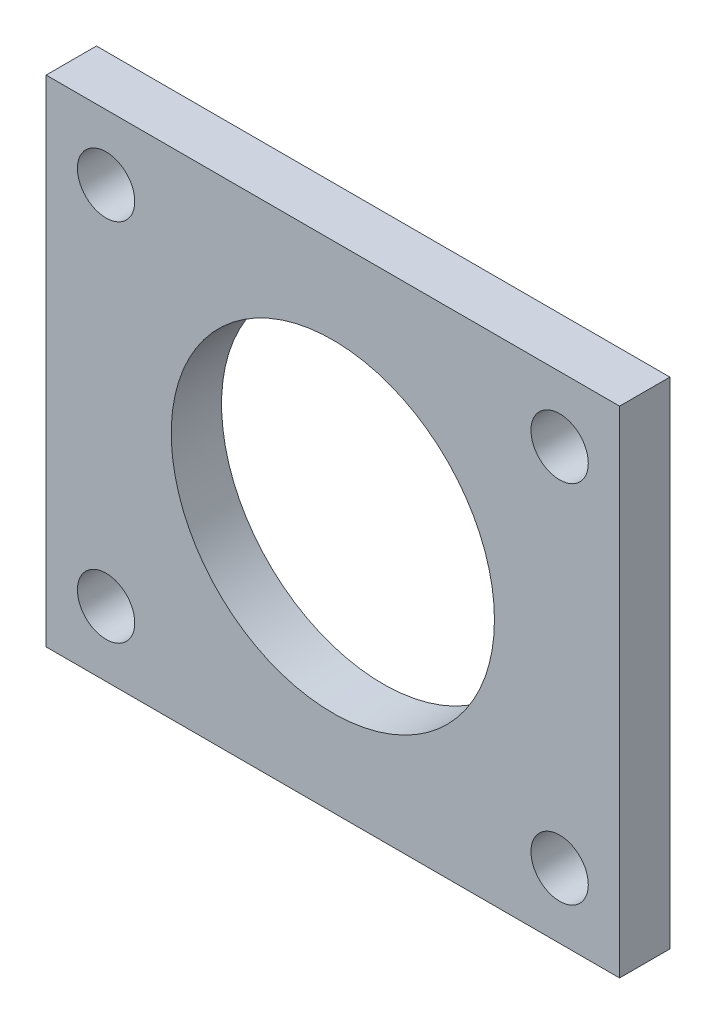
ISO-10303-21;
HEADER;
FILE_DESCRIPTION(('STEP AP214'),'2;1');
FILE_NAME('part.step','',(''),(''),'','','');
FILE_SCHEMA(('AUTOMOTIVE_DESIGN { 1 0 10303 214 1 1 1 1 }'));
ENDSEC;
DATA;
#1=APPLICATION_CONTEXT('core data for automotive mechanical design processes');
#2=APPLICATION_PROTOCOL_DEFINITION('international standard','automotive_design',2000,#1);
#3=PRODUCT_CONTEXT('',#1,'mechanical');
#4=PRODUCT('Part','Part','',(#3));
#5=PRODUCT_RELATED_PRODUCT_CATEGORY('part','',(#4));
#6=PRODUCT_DEFINITION_FORMATION('','',#4);
#7=PRODUCT_DEFINITION_CONTEXT('part definition',#1,'design');
#8=PRODUCT_DEFINITION('design','',#6,#7);
#9=PRODUCT_DEFINITION_SHAPE('','',#8);
#10=(LENGTH_UNIT() NAMED_UNIT(*) SI_UNIT(.MILLI.,.METRE.));
#11=(NAMED_UNIT(*) PLANE_ANGLE_UNIT() SI_UNIT($,.RADIAN.));
#12=(NAMED_UNIT(*) SI_UNIT($,.STERADIAN.) SOLID_ANGLE_UNIT());
#13=UNCERTAINTY_MEASURE_WITH_UNIT(LENGTH_MEASURE(1.E-05),#10,'distance_accuracy_value','');
#14=(GEOMETRIC_REPRESENTATION_CONTEXT(3) GLOBAL_UNCERTAINTY_ASSIGNED_CONTEXT((#13)) GLOBAL_UNIT_ASSIGNED_CONTEXT((#10,
#11,#12)) REPRESENTATION_CONTEXT('',''));
#15=CARTESIAN_POINT('',(0.,0.,0.));
#16=DIRECTION('',(0.,0.,1.));
#17=DIRECTION('',(1.,0.,0.));
#18=AXIS2_PLACEMENT_3D('',#15,#16,#17);
#19=CARTESIAN_POINT('',(0.,0.,9.65));
#20=DIRECTION('',(0.,0.,1.));
#21=DIRECTION('',(1.,0.,0.));
#22=AXIS2_PLACEMENT_3D('',#19,#20,#21);
#23=PLANE('',#22);
#24=CARTESIAN_POINT('',(43.5,-35.,9.65));
#25=DIRECTION('',(0.,0.,1.));
#26=DIRECTION('',(1.,0.,0.));
#27=AXIS2_PLACEMENT_3D('',#24,#25,#26);
#28=CIRCLE('',#27,5.5);
#29=CARTESIAN_POINT('',(49.,-35.,9.65));
#30=VERTEX_POINT('',#29);
#31=EDGE_CURVE('E127',#30,#30,#28,.T.);
#32=ORIENTED_EDGE('',*,*,#31,.F.);
#33=EDGE_LOOP('',(#32));
#34=FACE_BOUND('',#33,.T.);
#35=CARTESIAN_POINT('',(-43.5,35.,9.65));
#36=DIRECTION('',(0.,0.,1.));
#37=DIRECTION('',(1.,0.,0.));
#38=AXIS2_PLACEMENT_3D('',#35,#36,#37);
#39=CIRCLE('',#38,5.5);
#40=CARTESIAN_POINT('',(-38.,35.,9.65));
#41=VERTEX_POINT('',#40);
#42=EDGE_CURVE('E115',#41,#41,#39,.T.);
#43=ORIENTED_EDGE('',*,*,#42,.F.);
#44=EDGE_LOOP('',(#43));
#45=FACE_BOUND('',#44,.T.);
#46=DIRECTION('',(0.,-1.,0.));
#47=VECTOR('',#46,1.);
#48=CARTESIAN_POINT('',(-55.,-47.5,9.65));
#49=LINE('',#48,#47);
#50=CARTESIAN_POINT('',(-55.,47.5,9.65));
#51=VERTEX_POINT('',#50);
#52=CARTESIAN_POINT('',(-55.,-47.5,9.65));
#53=VERTEX_POINT('',#52);
#54=EDGE_CURVE('E85',#51,#53,#49,.T.);
#55=ORIENTED_EDGE('',*,*,#54,.T.);
#56=DIRECTION('',(1.,0.,0.));
#57=VECTOR('',#56,1.);
#58=CARTESIAN_POINT('',(55.,-47.5,9.65));
#59=LINE('',#58,#57);
#60=CARTESIAN_POINT('',(55.,-47.5,9.65));
#61=VERTEX_POINT('',#60);
#62=EDGE_CURVE('E80',#53,#61,#59,.T.);
#63=ORIENTED_EDGE('',*,*,#62,.T.);
#64=DIRECTION('',(0.,1.,0.));
#65=VECTOR('',#64,1.);
#66=CARTESIAN_POINT('',(55.,-47.5,9.65));
#67=LINE('',#66,#65);
#68=CARTESIAN_POINT('',(55.,47.5,9.65));
#69=VERTEX_POINT('',#68);
#70=EDGE_CURVE('E83',#61,#69,#67,.T.);
#71=ORIENTED_EDGE('',*,*,#70,.T.);
#72=DIRECTION('',(-1.,0.,0.));
#73=VECTOR('',#72,1.);
#74=CARTESIAN_POINT('',(55.,47.5,9.65));
#75=LINE('',#74,#73);
#76=EDGE_CURVE('E50',#69,#51,#75,.T.);
#77=ORIENTED_EDGE('',*,*,#76,.T.);
#78=EDGE_LOOP('',(#55,#63,#71,#77));
#79=FACE_BOUND('',#78,.T.);
#80=CARTESIAN_POINT('',(0.,0.,9.65));
#81=DIRECTION('',(0.,0.,1.));
#82=DIRECTION('',(1.,0.,0.));
#83=AXIS2_PLACEMENT_3D('',#80,#81,#82);
#84=CIRCLE('',#83,31.);
#85=CARTESIAN_POINT('',(31.,0.,9.65));
#86=VERTEX_POINT('',#85);
#87=EDGE_CURVE('E100',#86,#86,#84,.T.);
#88=ORIENTED_EDGE('',*,*,#87,.F.);
#89=EDGE_LOOP('',(#88));
#90=FACE_BOUND('',#89,.T.);
#91=CARTESIAN_POINT('',(43.5,35.,9.65));
#92=DIRECTION('',(0.,0.,1.));
#93=DIRECTION('',(1.,0.,0.));
#94=AXIS2_PLACEMENT_3D('',#91,#92,#93);
#95=CIRCLE('',#94,5.5);
#96=CARTESIAN_POINT('',(49.,35.,9.65));
#97=VERTEX_POINT('',#96);
#98=EDGE_CURVE('E121',#97,#97,#95,.T.);
#99=ORIENTED_EDGE('',*,*,#98,.F.);
#100=EDGE_LOOP('',(#99));
#101=FACE_BOUND('',#100,.T.);
#102=CARTESIAN_POINT('',(-43.5,-35.,9.65));
#103=DIRECTION('',(0.,0.,1.));
#104=DIRECTION('',(1.,0.,0.));
#105=AXIS2_PLACEMENT_3D('',#102,#103,#104);
#106=CIRCLE('',#105,5.5);
#107=CARTESIAN_POINT('',(-38.,-35.,9.65));
#108=VERTEX_POINT('',#107);
#109=EDGE_CURVE('E133',#108,#108,#106,.T.);
#110=ORIENTED_EDGE('',*,*,#109,.F.);
#111=EDGE_LOOP('',(#110));
#112=FACE_BOUND('',#111,.T.);
#113=ADVANCED_FACE('F33',(#34,#45,#79,#90,#101,#112),#23,.T.);
#114=CARTESIAN_POINT('',(0.,0.,0.));
#115=DIRECTION('',(0.,0.,1.));
#116=DIRECTION('',(1.,0.,0.));
#117=AXIS2_PLACEMENT_3D('',#114,#115,#116);
#118=PLANE('',#117);
#119=DIRECTION('',(0.,-1.,0.));
#120=VECTOR('',#119,1.);
#121=CARTESIAN_POINT('',(-55.,-47.5,0.));
#122=LINE('',#121,#120);
#123=CARTESIAN_POINT('',(-55.,47.5,0.));
#124=VERTEX_POINT('',#123);
#125=CARTESIAN_POINT('',(-55.,-47.5,0.));
#126=VERTEX_POINT('',#125);
#127=EDGE_CURVE('E97',#124,#126,#122,.T.);
#128=ORIENTED_EDGE('',*,*,#127,.F.);
#129=DIRECTION('',(-1.,0.,0.));
#130=VECTOR('',#129,1.);
#131=CARTESIAN_POINT('',(55.,47.5,0.));
#132=LINE('',#131,#130);
#133=CARTESIAN_POINT('',(55.,47.5,0.));
#134=VERTEX_POINT('',#133);
#135=EDGE_CURVE('E73',#134,#124,#132,.T.);
#136=ORIENTED_EDGE('',*,*,#135,.F.);
#137=DIRECTION('',(0.,1.,0.));
#138=VECTOR('',#137,1.);
#139=CARTESIAN_POINT('',(55.,-47.5,0.));
#140=LINE('',#139,#138);
#141=CARTESIAN_POINT('',(55.,-47.5,0.));
#142=VERTEX_POINT('',#141);
#143=EDGE_CURVE('E67',#142,#134,#140,.T.);
#144=ORIENTED_EDGE('',*,*,#143,.F.);
#145=DIRECTION('',(1.,0.,0.));
#146=VECTOR('',#145,1.);
#147=CARTESIAN_POINT('',(55.,-47.5,0.));
#148=LINE('',#147,#146);
#149=EDGE_CURVE('E89',#126,#142,#148,.T.);
#150=ORIENTED_EDGE('',*,*,#149,.F.);
#151=EDGE_LOOP('',(#128,#136,#144,#150));
#152=FACE_BOUND('',#151,.T.);
#153=CARTESIAN_POINT('',(0.,0.,0.));
#154=DIRECTION('',(0.,0.,1.));
#155=DIRECTION('',(1.,0.,0.));
#156=AXIS2_PLACEMENT_3D('',#153,#154,#155);
#157=CIRCLE('',#156,31.);
#158=CARTESIAN_POINT('',(31.,0.,0.));
#159=VERTEX_POINT('',#158);
#160=EDGE_CURVE('E112',#159,#159,#157,.T.);
#161=ORIENTED_EDGE('',*,*,#160,.T.);
#162=EDGE_LOOP('',(#161));
#163=FACE_BOUND('',#162,.T.);
#164=CARTESIAN_POINT('',(-43.5,35.,0.));
#165=DIRECTION('',(0.,0.,1.));
#166=DIRECTION('',(1.,0.,0.));
#167=AXIS2_PLACEMENT_3D('',#164,#165,#166);
#168=CIRCLE('',#167,5.5);
#169=CARTESIAN_POINT('',(-38.,35.,0.));
#170=VERTEX_POINT('',#169);
#171=EDGE_CURVE('E118',#170,#170,#168,.T.);
#172=ORIENTED_EDGE('',*,*,#171,.T.);
#173=EDGE_LOOP('',(#172));
#174=FACE_BOUND('',#173,.T.);
#175=CARTESIAN_POINT('',(43.5,35.,0.));
#176=DIRECTION('',(0.,0.,1.));
#177=DIRECTION('',(1.,0.,0.));
#178=AXIS2_PLACEMENT_3D('',#175,#176,#177);
#179=CIRCLE('',#178,5.5);
#180=CARTESIAN_POINT('',(49.,35.,0.));
#181=VERTEX_POINT('',#180);
#182=EDGE_CURVE('E124',#181,#181,#179,.T.);
#183=ORIENTED_EDGE('',*,*,#182,.T.);
#184=EDGE_LOOP('',(#183));
#185=FACE_BOUND('',#184,.T.);
#186=CARTESIAN_POINT('',(43.5,-35.,0.));
#187=DIRECTION('',(0.,0.,1.));
#188=DIRECTION('',(1.,0.,0.));
#189=AXIS2_PLACEMENT_3D('',#186,#187,#188);
#190=CIRCLE('',#189,5.5);
#191=CARTESIAN_POINT('',(49.,-35.,0.));
#192=VERTEX_POINT('',#191);
#193=EDGE_CURVE('E130',#192,#192,#190,.T.);
#194=ORIENTED_EDGE('',*,*,#193,.T.);
#195=EDGE_LOOP('',(#194));
#196=FACE_BOUND('',#195,.T.);
#197=CARTESIAN_POINT('',(-43.5,-35.,0.));
#198=DIRECTION('',(0.,0.,1.));
#199=DIRECTION('',(1.,0.,0.));
#200=AXIS2_PLACEMENT_3D('',#197,#198,#199);
#201=CIRCLE('',#200,5.5);
#202=CARTESIAN_POINT('',(-38.,-35.,0.));
#203=VERTEX_POINT('',#202);
#204=EDGE_CURVE('E136',#203,#203,#201,.T.);
#205=ORIENTED_EDGE('',*,*,#204,.T.);
#206=EDGE_LOOP('',(#205));
#207=FACE_BOUND('',#206,.T.);
#208=ADVANCED_FACE('F108',(#152,#163,#174,#185,#196,#207),#118,.F.);
#209=CARTESIAN_POINT('',(-55.,-47.5,9.65));
#210=DIRECTION('',(1.,0.,0.));
#211=DIRECTION('',(0.,0.,-1.));
#212=AXIS2_PLACEMENT_3D('',#209,#210,#211);
#213=PLANE('',#212);
#214=ORIENTED_EDGE('',*,*,#127,.T.);
#215=DIRECTION('',(0.,0.,-1.));
#216=VECTOR('',#215,1.);
#217=CARTESIAN_POINT('',(-55.,-47.5,9.65));
#218=LINE('',#217,#216);
#219=EDGE_CURVE('E11',#53,#126,#218,.T.);
#220=ORIENTED_EDGE('',*,*,#219,.F.);
#221=ORIENTED_EDGE('',*,*,#54,.F.);
#222=DIRECTION('',(0.,0.,-1.));
#223=VECTOR('',#222,1.);
#224=CARTESIAN_POINT('',(-55.,47.5,9.65));
#225=LINE('',#224,#223);
#226=EDGE_CURVE('E93',#51,#124,#225,.T.);
#227=ORIENTED_EDGE('',*,*,#226,.T.);
#228=EDGE_LOOP('',(#214,#220,#221,#227));
#229=FACE_BOUND('',#228,.T.);
#230=ADVANCED_FACE('F35',(#229),#213,.F.);
#231=CARTESIAN_POINT('',(55.,-47.5,9.65));
#232=DIRECTION('',(0.,1.,0.));
#233=DIRECTION('',(-1.,0.,0.));
#234=AXIS2_PLACEMENT_3D('',#231,#232,#233);
#235=PLANE('',#234);
#236=ORIENTED_EDGE('',*,*,#149,.T.);
#237=DIRECTION('',(0.,0.,-1.));
#238=VECTOR('',#237,1.);
#239=CARTESIAN_POINT('',(55.,-47.5,9.65));
#240=LINE('',#239,#238);
#241=EDGE_CURVE('E42',#61,#142,#240,.T.);
#242=ORIENTED_EDGE('',*,*,#241,.F.);
#243=ORIENTED_EDGE('',*,*,#62,.F.);
#244=ORIENTED_EDGE('',*,*,#219,.T.);
#245=EDGE_LOOP('',(#236,#242,#243,#244));
#246=FACE_BOUND('',#245,.T.);
#247=ADVANCED_FACE('F88',(#246),#235,.F.);
#248=CARTESIAN_POINT('',(55.,-47.5,9.65));
#249=DIRECTION('',(-1.,0.,0.));
#250=DIRECTION('',(0.,-1.,0.));
#251=AXIS2_PLACEMENT_3D('',#248,#249,#250);
#252=PLANE('',#251);
#253=ORIENTED_EDGE('',*,*,#143,.T.);
#254=DIRECTION('',(0.,0.,-1.));
#255=VECTOR('',#254,1.);
#256=CARTESIAN_POINT('',(55.,47.5,9.65));
#257=LINE('',#256,#255);
#258=EDGE_CURVE('E90',#69,#134,#257,.T.);
#259=ORIENTED_EDGE('',*,*,#258,.F.);
#260=ORIENTED_EDGE('',*,*,#70,.F.);
#261=ORIENTED_EDGE('',*,*,#241,.T.);
#262=EDGE_LOOP('',(#253,#259,#260,#261));
#263=FACE_BOUND('',#262,.T.);
#264=ADVANCED_FACE('F91',(#263),#252,.F.);
#265=CARTESIAN_POINT('',(55.,47.5,9.65));
#266=DIRECTION('',(0.,-1.,0.));
#267=DIRECTION('',(1.,0.,0.));
#268=AXIS2_PLACEMENT_3D('',#265,#266,#267);
#269=PLANE('',#268);
#270=ORIENTED_EDGE('',*,*,#135,.T.);
#271=ORIENTED_EDGE('',*,*,#226,.F.);
#272=ORIENTED_EDGE('',*,*,#76,.F.);
#273=ORIENTED_EDGE('',*,*,#258,.T.);
#274=EDGE_LOOP('',(#270,#271,#272,#273));
#275=FACE_BOUND('',#274,.T.);
#276=ADVANCED_FACE('F105',(#275),#269,.F.);
#277=CARTESIAN_POINT('',(0.,0.,9.65));
#278=DIRECTION('',(0.,0.,-1.));
#279=DIRECTION('',(-1.,0.,0.));
#280=AXIS2_PLACEMENT_3D('',#277,#278,#279);
#281=CYLINDRICAL_SURFACE('',#280,31.);
#282=ORIENTED_EDGE('',*,*,#87,.T.);
#283=EDGE_LOOP('',(#282));
#284=FACE_BOUND('',#283,.T.);
#285=ORIENTED_EDGE('',*,*,#160,.F.);
#286=EDGE_LOOP('',(#285));
#287=FACE_BOUND('',#286,.T.);
#288=ADVANCED_FACE('F155',(#284,#287),#281,.F.);
#289=CARTESIAN_POINT('',(-43.5,35.,9.65));
#290=DIRECTION('',(0.,0.,-1.));
#291=DIRECTION('',(-1.,0.,0.));
#292=AXIS2_PLACEMENT_3D('',#289,#290,#291);
#293=CYLINDRICAL_SURFACE('',#292,5.5);
#294=ORIENTED_EDGE('',*,*,#42,.T.);
#295=EDGE_LOOP('',(#294));
#296=FACE_BOUND('',#295,.T.);
#297=ORIENTED_EDGE('',*,*,#171,.F.);
#298=EDGE_LOOP('',(#297));
#299=FACE_BOUND('',#298,.T.);
#300=ADVANCED_FACE('F201',(#296,#299),#293,.F.);
#301=CARTESIAN_POINT('',(43.5,35.,9.65));
#302=DIRECTION('',(0.,0.,-1.));
#303=DIRECTION('',(-1.,0.,0.));
#304=AXIS2_PLACEMENT_3D('',#301,#302,#303);
#305=CYLINDRICAL_SURFACE('',#304,5.5);
#306=ORIENTED_EDGE('',*,*,#98,.T.);
#307=EDGE_LOOP('',(#306));
#308=FACE_BOUND('',#307,.T.);
#309=ORIENTED_EDGE('',*,*,#182,.F.);
#310=EDGE_LOOP('',(#309));
#311=FACE_BOUND('',#310,.T.);
#312=ADVANCED_FACE('F209',(#308,#311),#305,.F.);
#313=CARTESIAN_POINT('',(43.5,-35.,9.65));
#314=DIRECTION('',(0.,0.,-1.));
#315=DIRECTION('',(-1.,0.,0.));
#316=AXIS2_PLACEMENT_3D('',#313,#314,#315);
#317=CYLINDRICAL_SURFACE('',#316,5.5);
#318=ORIENTED_EDGE('',*,*,#31,.T.);
#319=EDGE_LOOP('',(#318));
#320=FACE_BOUND('',#319,.T.);
#321=ORIENTED_EDGE('',*,*,#193,.F.);
#322=EDGE_LOOP('',(#321));
#323=FACE_BOUND('',#322,.T.);
#324=ADVANCED_FACE('F217',(#320,#323),#317,.F.);
#325=CARTESIAN_POINT('',(-43.5,-35.,9.65));
#326=DIRECTION('',(0.,0.,-1.));
#327=DIRECTION('',(-1.,0.,0.));
#328=AXIS2_PLACEMENT_3D('',#325,#326,#327);
#329=CYLINDRICAL_SURFACE('',#328,5.5);
#330=ORIENTED_EDGE('',*,*,#109,.T.);
#331=EDGE_LOOP('',(#330));
#332=FACE_BOUND('',#331,.T.);
#333=ORIENTED_EDGE('',*,*,#204,.F.);
#334=EDGE_LOOP('',(#333));
#335=FACE_BOUND('',#334,.T.);
#336=ADVANCED_FACE('F142',(#332,#335),#329,.F.);
#337=CLOSED_SHELL('',(#113,#208,#230,#247,#264,#276,#288,#300,#312,#324,#336));
#338=MANIFOLD_SOLID_BREP('B2',#337);
#339=ADVANCED_BREP_SHAPE_REPRESENTATION('',(#18,#338),#14);
#340=SHAPE_DEFINITION_REPRESENTATION(#9,#339);
ENDSEC;
END-ISO-10303-21;
